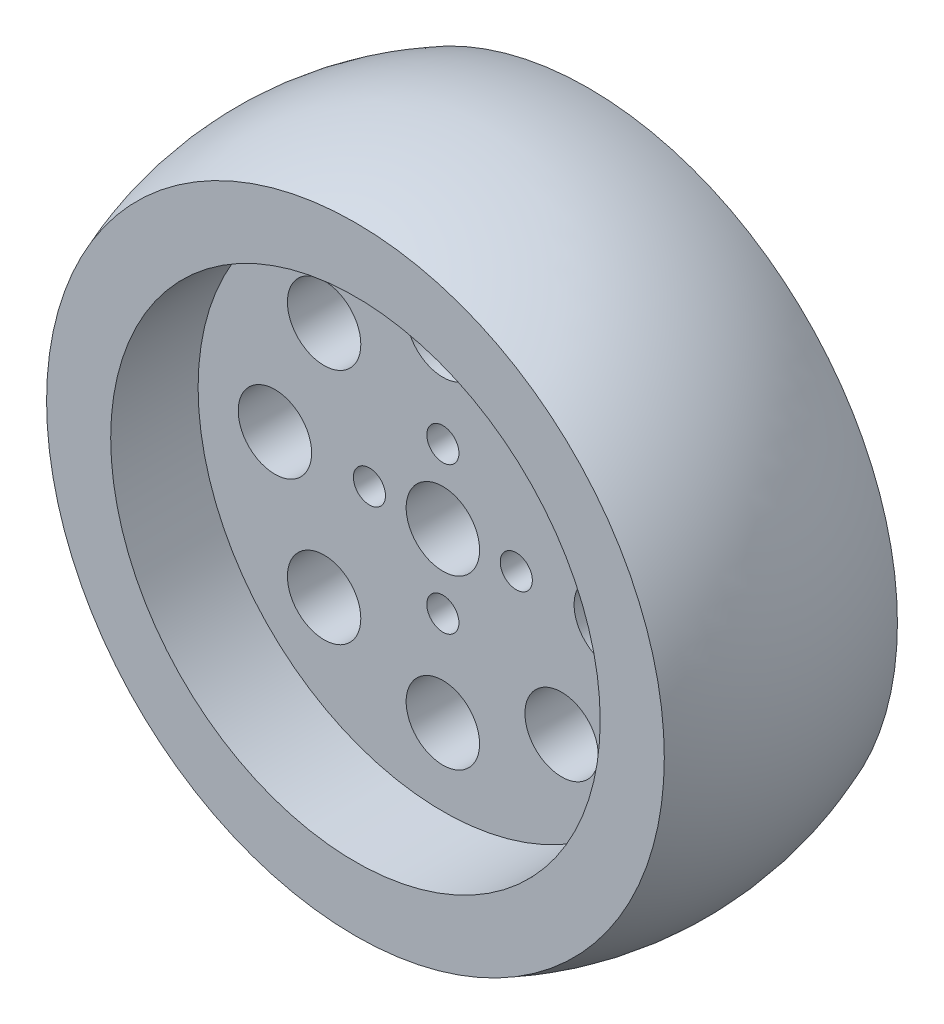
from build123d import *

# Parameters (mm, degrees)
SKETCH1_R          = 31.75
EXTRUDE1_DEPTH     = 21.082
SKETCH2_R          = 26.67
CUT_EXTRUDE1_DEPTH = 7.366
CUT_EXTRUDE2_START = -7.366
SKETCH3_R          = 26.67
CUT_EXTRUDE2_DEPTH = 7.366
SKETCH5_R          = 33.655
EXTRUDE3_DEPTH     = 2.159
CUT_EXTRUDE3_REACH = 54.967
SKETCH6_R          = 26.67
EXTRUDE4_START     = 2.159
SKETCH7_R          = 33.655
EXTRUDE4_DEPTH     = 2.159
CUT_EXTRUDE4_REACH = 55.949
SKETCH8_R          = 26.67
SKETCH10_R         = 4
SKETCH10_R_2       = 1.75
CUT_EXTRUDE5_DEPTH = 54.462758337
SKETCH11_R         = 4
CUT_EXTRUDE6_DEPTH = 54.462758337
SKETCH12_R         = 4
CUT_EXTRUDE7_DEPTH = 54.462758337


with BuildPart() as part:
    # Sketch1 → Extrude1 (new body)
    with BuildSketch(Plane.XY):
        Circle(SKETCH1_R)
    extrude(amount=-EXTRUDE1_DEPTH)

    # Sketch2 → Cut-Extrude1 (cut)
    with BuildSketch(Plane.XY):
        Circle(SKETCH2_R)
    extrude(amount=-CUT_EXTRUDE1_DEPTH, mode=Mode.SUBTRACT)

    # Sketch3 → Cut-Extrude2 (cut)
    with BuildSketch(Plane(origin=(0, 0, -21.082), x_dir=(-1, 0, 0), z_dir=(0, 0, -1)).offset(CUT_EXTRUDE2_START)):
        with Locations(Location((0, 0, 0), (0, 0, 180))):
            Circle(SKETCH3_R)
    extrude(amount=CUT_EXTRUDE2_DEPTH, mode=Mode.SUBTRACT)

    # Sketch5 → Extrude3 (add)
    with BuildSketch(Plane.XY):
        Circle(SKETCH5_R)
    extrude(amount=EXTRUDE3_DEPTH)

    # Sketch6 → Cut-Extrude3 (cut, up to next)
    with BuildSketch(Plane.XY.offset(2.159), mode=Mode.PRIVATE) as cut_extrude3_sk1:
        with Locations(Location((0, 0, 0), (0, 0, 180))):
            Circle(SKETCH6_R)
    cut_extrude3_tool1 = extrude(cut_extrude3_sk1.sketch, amount=-CUT_EXTRUDE3_REACH, mode=Mode.PRIVATE) & part.part
    add(cut_extrude3_tool1.solids().sort_by_distance((0, 0, 2.159))[0], mode=Mode.SUBTRACT)

    # Sketch7 → Extrude4 (add)
    with BuildSketch(Plane(origin=(0, 0, -21.082), x_dir=(-1, 0, 0), z_dir=(0, 0, -1)).offset(EXTRUDE4_START)):
        with Locations(Location((0, 0, 0), (0, 0, 180))):
            Circle(SKETCH7_R)
    extrude(amount=-EXTRUDE4_DEPTH)

    # Sketch8 → Cut-Extrude4 (cut, up to next)
    with BuildSketch(Plane(origin=(0, 0, -23.241), x_dir=(-1, 0, 0), z_dir=(0, 0, -1)), mode=Mode.PRIVATE) as cut_extrude4_sk1:
        with Locations(Location((0, 0, 0), (0, 0, 180))):
            Circle(SKETCH8_R)
    cut_extrude4_tool1 = extrude(cut_extrude4_sk1.sketch, amount=-CUT_EXTRUDE4_REACH, mode=Mode.PRIVATE) & part.part
    add(cut_extrude4_tool1.solids().sort_by_distance((0, 0, -23.241))[0], mode=Mode.SUBTRACT)

    # Sweep2: sweep along a curve in space
    with BuildLine() as sweep2_path:
        ThreePointArc((33.655, 0, 2.159), (23.797678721, 23.797678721, 2.159), (0, 33.655, 2.159))
        ThreePointArc((0, 33.655, 2.159), (-23.797678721, 23.797678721, 2.159), (-33.655, 0, 2.159))
        ThreePointArc((-33.655, 0, 2.159), (-23.797678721, -23.797678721, 2.159), (0, -33.655, 2.159))
        ThreePointArc((0, -33.655, 2.159), (23.797678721, -23.797678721, 2.159), (33.655, 0, 2.159))
    # 3DSketch2 → Sweep2 (sweep)
    with BuildSketch(Plane(origin=(0, 33.655, 2.159), x_dir=(-8.931812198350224e-14, -0.9285876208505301, -0.37111323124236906), z_dir=(1, 0, 0))):
        with BuildLine():
            Line((0, 0), (0.801233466, 2.004820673))
            Line((0.801233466, 2.004820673), (2.570192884, 1.297849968))
            Line((2.570192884, 1.297849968), (10.394002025, 20.874334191))
            Line((10.394002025, 20.874334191), (8.625042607, 21.581304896))
            Line((8.625042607, 21.581304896), (9.426276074, 23.58612557))
            ThreePointArc((9.426276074, 23.58612557), (2.443828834, 12.7), (0, 0))
        make_face()
    sweep(path=sweep2_path.line)

    # Sketch10 → Cut-Extrude5 (cut, through all)
    with BuildSketch(Plane.XY.offset(-7.366)):
        Circle(SKETCH10_R)
        with Locations((0, 8)):
            Circle(SKETCH10_R_2)
        with Locations((8, 0)):
            Circle(SKETCH10_R_2)
        with Locations((0, -8)):
            Circle(SKETCH10_R_2)
        with Locations((-8, 0)):
            Circle(SKETCH10_R_2)
    extrude(amount=-CUT_EXTRUDE5_DEPTH, mode=Mode.SUBTRACT)

    # Sketch11 → Cut-Extrude6 (cut, through all)
    with BuildSketch(Plane.XY.offset(-7.366)):
        with Locations((0, 18.3)):
            Circle(SKETCH11_R)
        with Locations((18.3, 0)):
            Circle(SKETCH11_R)
        with Locations((0, -18.3)):
            Circle(SKETCH11_R)
        with Locations((-18.3, 0)):
            Circle(SKETCH11_R)
    extrude(amount=-CUT_EXTRUDE6_DEPTH, mode=Mode.SUBTRACT)

    # Sketch12 → Cut-Extrude7 (cut, through all)
    with BuildSketch(Plane.XY.offset(-7.366)):
        with Locations((12.940054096, 12.940054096)):
            Circle(SKETCH12_R)
        with Locations((12.940054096, -12.940054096)):
            Circle(SKETCH12_R)
        with Locations((-12.940054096, -12.940054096)):
            Circle(SKETCH12_R)
        with Locations((-12.940054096, 12.940054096)):
            Circle(SKETCH12_R)
    extrude(amount=-CUT_EXTRUDE7_DEPTH, mode=Mode.SUBTRACT)


solid = part.part
